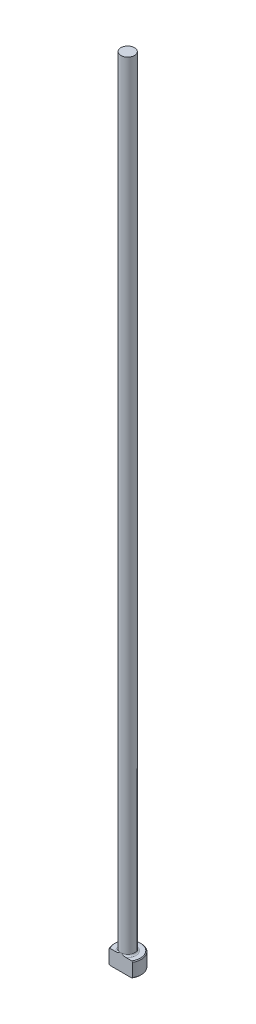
from build123d import *

# Parameters (mm, degrees)
CHAMFER1_SIZE = 0.254
FILLET1_R     = 0.508
KEY_DEPTH     = 255.074696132


with BuildPart() as part:
    # Sketch1 → Revolve1 (revolve)
    with BuildSketch(Plane.XY, mode=Mode.PRIVATE) as revolve1_sk:
        Polygon((0, 0), (-4.3561, 0), (-4.3561, 4.7498), (-2.18186, 4.7498), (-2.18186, 254), (0, 254), align=None)
    revolve(revolve1_sk.sketch.rotate(Axis((0, 259.958771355, 0), (0, -1, 0)), 270), axis=Axis((0, 259.958771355, 0), (0, -1, 0)))

    # Chamfer1
    chamfer1_edges = [part.edges().sort_by_distance(p)[0] for p in [
        (0, 4.7498, -4.3561),
        (0, 0, -4.3561),
    ]]
    chamfer(chamfer1_edges, length=CHAMFER1_SIZE)

    # Fillet1
    fillet1_edges = [part.edges().sort_by_distance(p)[0] for p in [
        (0, 4.7498, -2.18186),
    ]]
    fillet(fillet1_edges, radius=FILLET1_R)

    # Sketch2 → Key (cut, through all)
    with BuildSketch(Plane(origin=(0, 0, 0), x_dir=(1, 0, 0), z_dir=(0, 1, 0))):
        with BuildLine():
            Line((-3.77029099, -2.18186), (3.77029099, -2.18186))
            ThreePointArc((3.77029099, -2.18186), (0, -4.3561), (-3.77029099, -2.18186))
        make_face()
    extrude(amount=KEY_DEPTH, mode=Mode.SUBTRACT)


solid = part.part
